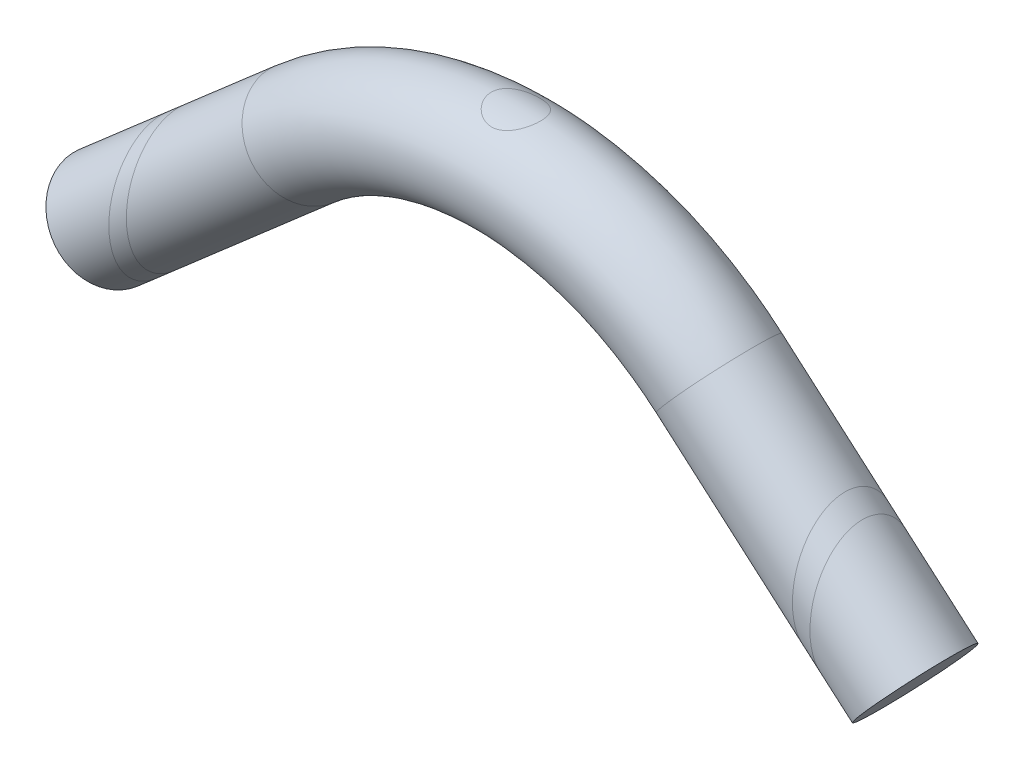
from build123d import *

# Parameters (mm, degrees)
SKETCH3_R = 15


with BuildPart() as part:
    # Sweep1: sweep along a path in Sketch1
    with BuildLine(Plane.XY) as sweep1_path:
        ThreePointArc((115, 70.732386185), (83.47465091, 65.03038358), (55.943915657, 48.64688318))
        Line((55.943915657, 48.64688318), (0, 0))
    # Sketch3 → Sweep1 (sweep)
    with BuildSketch(Plane(origin=(115, 0, 0), x_dir=(0, 0, -1), z_dir=(1, 0, 0))):
        with Locations((0, 70.732386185)):
            Circle(SKETCH3_R)
    sweep1 = sweep(path=sweep1_path.line)

    # Mirror1: Sweep1 across plane
    add(sweep1.mirror(Plane(origin=(115, 0, 0), x_dir=(0, 0, 1), z_dir=(1, 0, 0))))


solid = part.part
